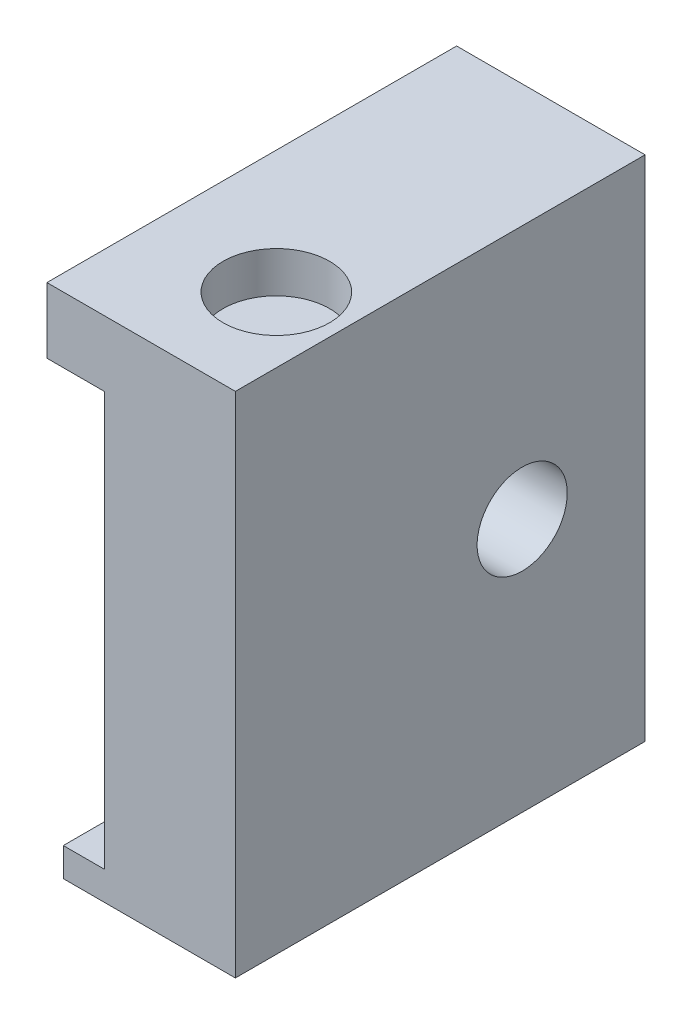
from build123d import *

# Parameters (mm, degrees)
BASE_EXTRUSION_DEPTH    = 50
ESQUISSE2_R             = 5.5
ENL_V_MAT_EXTRU_1_DEPTH = 50
ESQUISSE3_R             = 6.5
ENL_V_MAT_EXTRU_2_DEPTH = 5


with BuildPart() as part:
    # Esquisse1 → Base-Extrusion (new body)
    with BuildSketch(Plane.XY):
        Polygon((0, 62), (0, 0), (-21, 0), (-21, 3.5), (-16, 3.5), (-16, 54), (-23, 54), (-23, 62), align=None)
    extrude(amount=-BASE_EXTRUSION_DEPTH)

    # Esquisse2 → Enl_v. mat.-Extru.1 (cut)
    with BuildSketch(Plane.ZY.offset(16)):
        with Locations(Location((-35, 31, 0), (0, 0, 270))):
            Circle(ESQUISSE2_R)
    extrude(amount=-ENL_V_MAT_EXTRU_1_DEPTH, mode=Mode.SUBTRACT)

    # Esquisse3 → Enl_v. mat.-Extru.2 (cut)
    with BuildSketch(Plane(origin=(0, 62, 0), x_dir=(-1, 0, 0), z_dir=(0, 1, 0))):
        with Locations(Location((8, -13, 0), (0, 0, 90))):
            Circle(ESQUISSE3_R)
    extrude(amount=-ENL_V_MAT_EXTRU_2_DEPTH, mode=Mode.SUBTRACT)


solid = part.part
